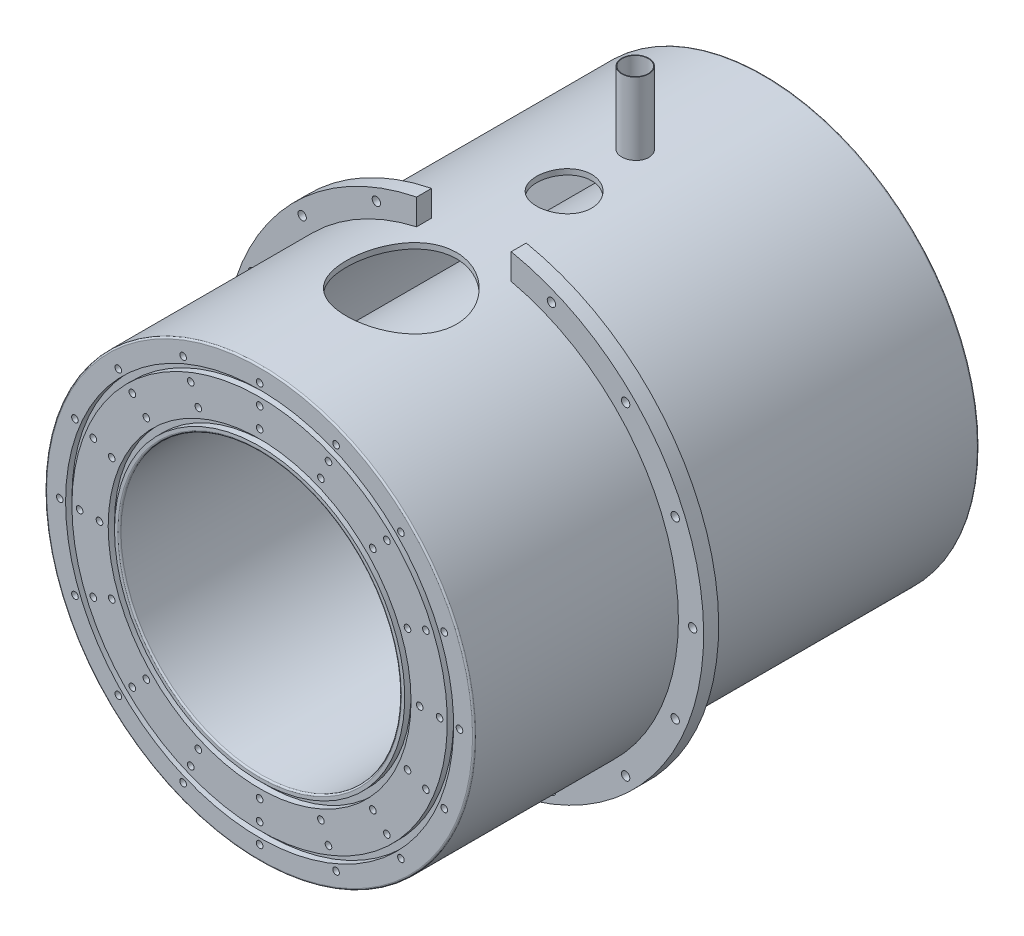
from build123d import *
from build123d.topology import SkipClean

# Parameters (mm, degrees)
SKETCH1_R                      = 92
SKETCH1_R_2                    = 88.9
BOSS_EXTRUDE1_DEPTH            = 140
SKETCH2_R                      = 136
SKETCH2_R_2                    = 132.5
BOSS_EXTRUDE2_DEPTH            = 140
BOSS_EXTRUDE3_START            = 20
SKETCH3_R                      = 136
SKETCH3_R_2                    = 88.9
BOSS_EXTRUDE3_DEPTH            = 20
SKETCH6_R                      = 17.4625
SKETCH6_R_2                    = 34.925
CUT_EXTRUDE5_DEPTH             = 25.4
SKETCH5_R                      = 8.6106
SKETCH5_R_2                    = 8.255
EXTRUDE_THIN1_DEPTH            = 50.8
SKETCH8_R                      = 152
SKETCH8_R_2                    = 136
BOSS_EXTRUDE5_DEPTH            = 9.525
SKETCH10_R                     = 123
SKETCH10_R_2                   = 119
CUT_EXTRUDE7_DEPTH             = 4
CUT_EXTRUDE8_START             = -4
SKETCH11_R                     = 96
SKETCH11_R_2                   = 92
CUT_EXTRUDE8_DEPTH             = 4
M5X0_8_TAPPED_HOLE1_AT_2_COUNT = 2
M5X0_8_TAPPED_HOLE1_AT_2_PITCH = 12.6
M5X0_8_TAPPED_HOLE1_AT_3_COUNT = 2
M5X0_8_TAPPED_HOLE1_AT_3_PITCH = 25.2
CIRPATTERN4_COUNT              = 16
CIRPATTERN5_COUNT              = 16
FILLET2_R                      = 1
CUT_EXTRUDE9_DEPTH             = 10
CUT_EXTRUDE9_DEPTH_BACK        = 15


with BuildPart() as part:
    # Sketch1 → Boss-Extrude1 (new, symmetric)
    with BuildSketch(Plane.XY):
        Circle(SKETCH1_R)
        Circle(SKETCH1_R_2, mode=Mode.SUBTRACT)
    extrude(amount=BOSS_EXTRUDE1_DEPTH, both=True)



with BuildPart() as body_2:
    # Sketch2 → Boss-Extrude2 (new, symmetric)
    with BuildSketch(Plane.XY):
        Circle(SKETCH2_R)
        Circle(SKETCH2_R_2, mode=Mode.SUBTRACT)
    extrude(amount=BOSS_EXTRUDE2_DEPTH, both=True)


with BuildPart() as part_1:
    with SkipClean():  # the faces are left unmerged after this step: merging them gives an invalid solid
        add(part.part)

        add(body_2.part)  # Boss-Extrude3 merges body 2
        # Sketch3 → Boss-Extrude3 (add)
        with BuildSketch(Plane(origin=(0, 0, -140), x_dir=(-1, 0, 0), z_dir=(0, 0, -1)).offset(BOSS_EXTRUDE3_START)):
            with Locations(Location((0, 0, 0), (0, 0, 180))):
                Circle(SKETCH3_R)
            Circle(SKETCH3_R_2, mode=Mode.SUBTRACT)
        boss_extrude3 = extrude(amount=-BOSS_EXTRUDE3_DEPTH)

    # Mirror1: Boss-Extrude3 across plane
    with SkipClean():  # the faces are left unmerged after this step: merging them gives an invalid solid
        add(boss_extrude3.mirror(Plane.XY))

    # Sketch6 → Cut-Extrude5 (cut)
    with SkipClean():  # the faces are left unmerged after this step: merging them gives an invalid solid
        with BuildSketch(Plane(origin=(0, 114.3, 0), x_dir=(-1, 0, 0), z_dir=(0, 1, 0))):
            with Locations(Location((0, -33, 0), (0, 0, 270))):
                Circle(SKETCH6_R)
            with Locations(Location((0, 70.13952, 0), (0, 0, 270))):
                Circle(SKETCH6_R_2)
        extrude(amount=CUT_EXTRUDE5_DEPTH, mode=Mode.SUBTRACT)

    # Sketch8 → Boss-Extrude5 (add)
    with SkipClean():  # the faces are left unmerged after this step: merging them gives an invalid solid
        with BuildSketch(Plane(origin=(0, 0, 30.5), x_dir=(-1, 0, 0), z_dir=(0, 0, -1))):
            with Locations(Location((0, 0, 0), (0, 0, 180))):
                Circle(SKETCH8_R)
            Circle(SKETCH8_R_2, mode=Mode.SUBTRACT)
        extrude(amount=BOSS_EXTRUDE5_DEPTH)

    # Sketch10 → Cut-Extrude7 (cut)
    with SkipClean():  # the faces are left unmerged after this step: merging them gives an invalid solid
        with BuildSketch(Plane(origin=(0, 0, -160), x_dir=(-1, 0, 0), z_dir=(0, 0, -1))):
            Circle(SKETCH10_R)
            Circle(SKETCH10_R_2, mode=Mode.SUBTRACT)
        cut_extrude7 = extrude(amount=-CUT_EXTRUDE7_DEPTH, mode=Mode.SUBTRACT)

    # Sketch11 → Cut-Extrude8 (cut)
    with SkipClean():  # the faces are left unmerged after this step: merging them gives an invalid solid
        with BuildSketch(Plane(origin=(0, 0, -160), x_dir=(-1, 0, 0), z_dir=(0, 0, -1)).offset(CUT_EXTRUDE8_START)):
            Circle(SKETCH11_R)
            Circle(SKETCH11_R_2, mode=Mode.SUBTRACT)
        cut_extrude8 = extrude(amount=CUT_EXTRUDE8_DEPTH, mode=Mode.SUBTRACT)

    # Mirror3: Cut-Extrude7, Cut-Extrude8 across plane
    with SkipClean():  # the faces are left unmerged after this step: merging them gives an invalid solid
        add(cut_extrude7.mirror(Plane.XY), mode=Mode.SUBTRACT)
        add(cut_extrude8.mirror(Plane.XY), mode=Mode.SUBTRACT)

    # Sketch12 → M5x0.8 Tapped Hole1 (revolve, cut)
    with SkipClean():  # the faces are left unmerged after this step: merging them gives an invalid solid
        with BuildSketch(Plane(origin=(-101.5, 0, -160), x_dir=(0, 1, 0), z_dir=(1, 0, 0))):
            Polygon((0, 0), (0, 13.6618073), (2.1, 12.4), (2.1, 0), align=None)
        m5x0_8_tapped_hole1 = revolve(axis=Axis((-101.5, 0, -166.35), (0, 0, 1)), mode=Mode.SUBTRACT)

    # M5x0.8 Tapped Hole1 at 2: M5x0.8 Tapped Hole1 ×2
    with SkipClean():  # the faces are left unmerged after this step: merging them gives an invalid solid
        with Locations(*[(-i * M5X0_8_TAPPED_HOLE1_AT_2_PITCH, 0, 0) for i in range(1, M5X0_8_TAPPED_HOLE1_AT_2_COUNT)]):
            add(m5x0_8_tapped_hole1, mode=Mode.SUBTRACT)

    # M5x0.8 Tapped Hole1 at 3: M5x0.8 Tapped Hole1 ×2
    with SkipClean():  # the faces are left unmerged after this step: merging them gives an invalid solid
        with Locations(*[(-i * M5X0_8_TAPPED_HOLE1_AT_3_PITCH, 0, 0) for i in range(1, M5X0_8_TAPPED_HOLE1_AT_3_COUNT)]):
            add(m5x0_8_tapped_hole1, mode=Mode.SUBTRACT)

    # Sketch13 → M5 Clearance Hole1 (revolve, cut)
    with SkipClean():  # the faces are left unmerged after this step: merging them gives an invalid solid
        with BuildSketch(Plane(origin=(0, 145, 20.975), x_dir=(0, 1, 0), z_dir=(1, 0, 0))):
            Polygon((0, 0), (0, 26.99228064), (2.65, 25.4), (2.65, 0), align=None)
        m5_clearance_hole1 = revolve(axis=Axis((0, 145, 14.625), (0, 0, 1)), mode=Mode.SUBTRACT)

    # CirPattern4: M5 Clearance Hole1 ×16 about axis
    with SkipClean():  # the faces are left unmerged after this step: merging them gives an invalid solid
        cirpattern4_axis = Axis((0, 0, 0), (0, 0, 1))
        for i in range(1, CIRPATTERN4_COUNT):
            add(m5_clearance_hole1.rotate(cirpattern4_axis, i * 360 / CIRPATTERN4_COUNT), mode=Mode.SUBTRACT)

    # Mirror4: M5x0.8 Tapped Hole1 across plane
    with SkipClean():  # the faces are left unmerged after this step: merging them gives an invalid solid
        add(m5x0_8_tapped_hole1.mirror(Plane.XY), mode=Mode.SUBTRACT)

    # Mirror4 copy 1 sketch → Mirror4 copy 1 (revolve, cut)
    with SkipClean():  # the faces are left unmerged after this step: merging them gives an invalid solid
        with BuildSketch(Plane(origin=(-114.1, 0, 160), x_dir=(0, 1, 0), z_dir=(1, 0, 0))):
            Polygon((0, 0), (0, -13.6618073), (2.1, -12.4), (2.1, 0), align=None)
        revolve(axis=Axis((-114.1, 0, 166.35), (0, 0, 1)), mode=Mode.SUBTRACT)

    # Mirror4 copy 2 sketch → Mirror4 copy 2 (revolve, cut)
    with SkipClean():  # the faces are left unmerged after this step: merging them gives an invalid solid
        with BuildSketch(Plane(origin=(-126.7, 0, 160), x_dir=(0, 1, 0), z_dir=(1, 0, 0))):
            Polygon((0, 0), (0, -13.6618073), (2.1, -12.4), (2.1, 0), align=None)
        revolve(axis=Axis((-126.7, 0, 166.35), (0, 0, 1)), mode=Mode.SUBTRACT)

    # CirPattern5: M5x0.8 Tapped Hole1 ×16 about axis
    with SkipClean():  # the faces are left unmerged after this step: merging them gives an invalid solid
        cirpattern5_axis = Axis((0, 0, 0), (0, 0, 1))
        for i in range(1, CIRPATTERN5_COUNT):
            add(m5x0_8_tapped_hole1.rotate(cirpattern5_axis, i * 360 / CIRPATTERN5_COUNT), mode=Mode.SUBTRACT)

    # CirPattern5 copy 1 sketch → CirPattern5 copy 1 (revolve, cut)
    with SkipClean():  # the faces are left unmerged after this step: merging them gives an invalid solid
        with BuildSketch(Plane(origin=(-105.41465466, -43.664179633, -160), x_dir=(-0.3826834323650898, 0.9238795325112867, 0), z_dir=(0.9238795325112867, 0.3826834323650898, 0))):
            Polygon((0, 0), (0, 13.6618073), (2.1, 12.4), (2.1, 0), align=None)
        revolve(axis=Axis((-105.41465466, -43.664179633, -166.35), (0, 0, 1)), mode=Mode.SUBTRACT)

    # CirPattern5 copy 2 sketch → CirPattern5 copy 2 (revolve, cut)
    with SkipClean():  # the faces are left unmerged after this step: merging them gives an invalid solid
        with BuildSketch(Plane(origin=(-80.680883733, -80.680883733, -160), x_dir=(-0.7071067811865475, 0.7071067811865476, 0), z_dir=(0.7071067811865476, 0.7071067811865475, 0))):
            Polygon((0, 0), (0, 13.6618073), (2.1, 12.4), (2.1, 0), align=None)
        revolve(axis=Axis((-80.680883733, -80.680883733, -166.35), (0, 0, 1)), mode=Mode.SUBTRACT)

    # CirPattern5 copy 3 sketch → CirPattern5 copy 3 (revolve, cut)
    with SkipClean():  # the faces are left unmerged after this step: merging them gives an invalid solid
        with BuildSketch(Plane(origin=(-43.664179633, -105.41465466, -160), x_dir=(-0.9238795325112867, 0.38268343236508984, 0), z_dir=(0.38268343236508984, 0.9238795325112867, 0))):
            Polygon((0, 0), (0, 13.6618073), (2.1, 12.4), (2.1, 0), align=None)
        revolve(axis=Axis((-43.664179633, -105.41465466, -166.35), (0, 0, 1)), mode=Mode.SUBTRACT)

    # CirPattern5 copy 4 sketch → CirPattern5 copy 4 (revolve, cut)
    with SkipClean():  # the faces are left unmerged after this step: merging them gives an invalid solid
        with BuildSketch(Plane(origin=(0, -114.1, -160), x_dir=(-1, 0, 0), z_dir=(0, 1, 0))):
            Polygon((0, 0), (0, 13.6618073), (2.1, 12.4), (2.1, 0), align=None)
        revolve(axis=Axis((0, -114.1, -166.35), (0, 0, 1)), mode=Mode.SUBTRACT)

    # CirPattern5 copy 5 sketch → CirPattern5 copy 5 (revolve, cut)
    with SkipClean():  # the faces are left unmerged after this step: merging them gives an invalid solid
        with BuildSketch(Plane(origin=(43.664179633, -105.41465466, -160), x_dir=(-0.9238795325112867, -0.3826834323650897, 0), z_dir=(-0.3826834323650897, 0.9238795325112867, 0))):
            Polygon((0, 0), (0, 13.6618073), (2.1, 12.4), (2.1, 0), align=None)
        revolve(axis=Axis((43.664179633, -105.41465466, -166.35), (0, 0, 1)), mode=Mode.SUBTRACT)

    # CirPattern5 copy 6 sketch → CirPattern5 copy 6 (revolve, cut)
    with SkipClean():  # the faces are left unmerged after this step: merging them gives an invalid solid
        with BuildSketch(Plane(origin=(80.680883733, -80.680883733, -160), x_dir=(-0.7071067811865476, -0.7071067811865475, 0), z_dir=(-0.7071067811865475, 0.7071067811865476, 0))):
            Polygon((0, 0), (0, 13.6618073), (2.1, 12.4), (2.1, 0), align=None)
        revolve(axis=Axis((80.680883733, -80.680883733, -166.35), (0, 0, 1)), mode=Mode.SUBTRACT)

    # CirPattern5 copy 7 sketch → CirPattern5 copy 7 (revolve, cut)
    with SkipClean():  # the faces are left unmerged after this step: merging them gives an invalid solid
        with BuildSketch(Plane(origin=(105.41465466, -43.664179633, -160), x_dir=(-0.3826834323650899, -0.9238795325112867, 0), z_dir=(-0.9238795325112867, 0.3826834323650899, 0))):
            Polygon((0, 0), (0, 13.6618073), (2.1, 12.4), (2.1, 0), align=None)
        revolve(axis=Axis((105.41465466, -43.664179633, -166.35), (0, 0, 1)), mode=Mode.SUBTRACT)

    # CirPattern5 copy 8 sketch → CirPattern5 copy 8 (revolve, cut)
    with SkipClean():  # the faces are left unmerged after this step: merging them gives an invalid solid
        with BuildSketch(Plane(origin=(114.1, 0, -160), x_dir=(0, -1, 0), z_dir=(-1, 0, 0))):
            Polygon((0, 0), (0, 13.6618073), (2.1, 12.4), (2.1, 0), align=None)
        revolve(axis=Axis((114.1, 0, -166.35), (0, 0, 1)), mode=Mode.SUBTRACT)

    # CirPattern5 copy 9 sketch → CirPattern5 copy 9 (revolve, cut)
    with SkipClean():  # the faces are left unmerged after this step: merging them gives an invalid solid
        with BuildSketch(Plane(origin=(105.41465466, 43.664179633, -160), x_dir=(0.38268343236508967, -0.9238795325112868, 0), z_dir=(-0.9238795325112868, -0.38268343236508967, 0))):
            Polygon((0, 0), (0, 13.6618073), (2.1, 12.4), (2.1, 0), align=None)
        revolve(axis=Axis((105.41465466, 43.664179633, -166.35), (0, 0, 1)), mode=Mode.SUBTRACT)

    # CirPattern5 copy 10 sketch → CirPattern5 copy 10 (revolve, cut)
    with SkipClean():  # the faces are left unmerged after this step: merging them gives an invalid solid
        with BuildSketch(Plane(origin=(80.680883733, 80.680883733, -160), x_dir=(0.7071067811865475, -0.7071067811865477, 0), z_dir=(-0.7071067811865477, -0.7071067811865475, 0))):
            Polygon((0, 0), (0, 13.6618073), (2.1, 12.4), (2.1, 0), align=None)
        revolve(axis=Axis((80.680883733, 80.680883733, -166.35), (0, 0, 1)), mode=Mode.SUBTRACT)

    # CirPattern5 copy 11 sketch → CirPattern5 copy 11 (revolve, cut)
    with SkipClean():  # the faces are left unmerged after this step: merging them gives an invalid solid
        with BuildSketch(Plane(origin=(43.664179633, 105.41465466, -160), x_dir=(0.9238795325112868, -0.3826834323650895, 0), z_dir=(-0.3826834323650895, -0.9238795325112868, 0))):
            Polygon((0, 0), (0, 13.6618073), (2.1, 12.4), (2.1, 0), align=None)
        revolve(axis=Axis((43.664179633, 105.41465466, -166.35), (0, 0, 1)), mode=Mode.SUBTRACT)

    # CirPattern5 copy 12 sketch → CirPattern5 copy 12 (revolve, cut)
    with SkipClean():  # the faces are left unmerged after this step: merging them gives an invalid solid
        with BuildSketch(Plane(origin=(0, 114.1, -160), x_dir=(1, 0, 0), z_dir=(0, -1, 0))):
            Polygon((0, 0), (0, 13.6618073), (2.1, 12.4), (2.1, 0), align=None)
        revolve(axis=Axis((0, 114.1, -166.35), (0, 0, 1)), mode=Mode.SUBTRACT)

    # CirPattern5 copy 13 sketch → CirPattern5 copy 13 (revolve, cut)
    with SkipClean():  # the faces are left unmerged after this step: merging them gives an invalid solid
        with BuildSketch(Plane(origin=(-43.664179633, 105.41465466, -160), x_dir=(0.9238795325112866, 0.38268343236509, 0), z_dir=(0.38268343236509, -0.9238795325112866, 0))):
            Polygon((0, 0), (0, 13.6618073), (2.1, 12.4), (2.1, 0), align=None)
        revolve(axis=Axis((-43.664179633, 105.41465466, -166.35), (0, 0, 1)), mode=Mode.SUBTRACT)

    # CirPattern5 copy 14 sketch → CirPattern5 copy 14 (revolve, cut)
    with SkipClean():  # the faces are left unmerged after this step: merging them gives an invalid solid
        with BuildSketch(Plane(origin=(-80.680883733, 80.680883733, -160), x_dir=(0.7071067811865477, 0.7071067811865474, 0), z_dir=(0.7071067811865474, -0.7071067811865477, 0))):
            Polygon((0, 0), (0, 13.6618073), (2.1, 12.4), (2.1, 0), align=None)
        revolve(axis=Axis((-80.680883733, 80.680883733, -166.35), (0, 0, 1)), mode=Mode.SUBTRACT)

    # CirPattern5 copy 15 sketch → CirPattern5 copy 15 (revolve, cut)
    with SkipClean():  # the faces are left unmerged after this step: merging them gives an invalid solid
        with BuildSketch(Plane(origin=(-105.41465466, 43.664179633, -160), x_dir=(0.38268343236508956, 0.9238795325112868, 0), z_dir=(0.9238795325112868, -0.38268343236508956, 0))):
            Polygon((0, 0), (0, 13.6618073), (2.1, 12.4), (2.1, 0), align=None)
        revolve(axis=Axis((-105.41465466, 43.664179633, -166.35), (0, 0, 1)), mode=Mode.SUBTRACT)

    # CirPattern5 copy 16 sketch → CirPattern5 copy 16 (revolve, cut)
    with SkipClean():  # the faces are left unmerged after this step: merging them gives an invalid solid
        with BuildSketch(Plane(origin=(-117.055536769, -48.485990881, -160), x_dir=(-0.3826834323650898, 0.9238795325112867, 0), z_dir=(0.9238795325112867, 0.3826834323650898, 0))):
            Polygon((0, 0), (0, 13.6618073), (2.1, 12.4), (2.1, 0), align=None)
        revolve(axis=Axis((-117.055536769, -48.485990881, -166.35), (0, 0, 1)), mode=Mode.SUBTRACT)

    # CirPattern5 copy 17 sketch → CirPattern5 copy 17 (revolve, cut)
    with SkipClean():  # the faces are left unmerged after this step: merging them gives an invalid solid
        with BuildSketch(Plane(origin=(-89.590429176, -89.590429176, -160), x_dir=(-0.7071067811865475, 0.7071067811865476, 0), z_dir=(0.7071067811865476, 0.7071067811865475, 0))):
            Polygon((0, 0), (0, 13.6618073), (2.1, 12.4), (2.1, 0), align=None)
        revolve(axis=Axis((-89.590429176, -89.590429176, -166.35), (0, 0, 1)), mode=Mode.SUBTRACT)

    # CirPattern5 copy 18 sketch → CirPattern5 copy 18 (revolve, cut)
    with SkipClean():  # the faces are left unmerged after this step: merging them gives an invalid solid
        with BuildSketch(Plane(origin=(-48.485990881, -117.055536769, -160), x_dir=(-0.9238795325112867, 0.38268343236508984, 0), z_dir=(0.38268343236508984, 0.9238795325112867, 0))):
            Polygon((0, 0), (0, 13.6618073), (2.1, 12.4), (2.1, 0), align=None)
        revolve(axis=Axis((-48.485990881, -117.055536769, -166.35), (0, 0, 1)), mode=Mode.SUBTRACT)

    # CirPattern5 copy 19 sketch → CirPattern5 copy 19 (revolve, cut)
    with SkipClean():  # the faces are left unmerged after this step: merging them gives an invalid solid
        with BuildSketch(Plane(origin=(0, -126.7, -160), x_dir=(-1, 0, 0), z_dir=(0, 1, 0))):
            Polygon((0, 0), (0, 13.6618073), (2.1, 12.4), (2.1, 0), align=None)
        revolve(axis=Axis((0, -126.7, -166.35), (0, 0, 1)), mode=Mode.SUBTRACT)

    # CirPattern5 copy 20 sketch → CirPattern5 copy 20 (revolve, cut)
    with SkipClean():  # the faces are left unmerged after this step: merging them gives an invalid solid
        with BuildSketch(Plane(origin=(48.485990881, -117.055536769, -160), x_dir=(-0.9238795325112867, -0.3826834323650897, 0), z_dir=(-0.3826834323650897, 0.9238795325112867, 0))):
            Polygon((0, 0), (0, 13.6618073), (2.1, 12.4), (2.1, 0), align=None)
        revolve(axis=Axis((48.485990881, -117.055536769, -166.35), (0, 0, 1)), mode=Mode.SUBTRACT)

    # CirPattern5 copy 21 sketch → CirPattern5 copy 21 (revolve, cut)
    with SkipClean():  # the faces are left unmerged after this step: merging them gives an invalid solid
        with BuildSketch(Plane(origin=(89.590429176, -89.590429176, -160), x_dir=(-0.7071067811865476, -0.7071067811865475, 0), z_dir=(-0.7071067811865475, 0.7071067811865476, 0))):
            Polygon((0, 0), (0, 13.6618073), (2.1, 12.4), (2.1, 0), align=None)
        revolve(axis=Axis((89.590429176, -89.590429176, -166.35), (0, 0, 1)), mode=Mode.SUBTRACT)

    # CirPattern5 copy 22 sketch → CirPattern5 copy 22 (revolve, cut)
    with SkipClean():  # the faces are left unmerged after this step: merging them gives an invalid solid
        with BuildSketch(Plane(origin=(117.055536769, -48.485990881, -160), x_dir=(-0.3826834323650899, -0.9238795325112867, 0), z_dir=(-0.9238795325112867, 0.3826834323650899, 0))):
            Polygon((0, 0), (0, 13.6618073), (2.1, 12.4), (2.1, 0), align=None)
        revolve(axis=Axis((117.055536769, -48.485990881, -166.35), (0, 0, 1)), mode=Mode.SUBTRACT)

    # CirPattern5 copy 23 sketch → CirPattern5 copy 23 (revolve, cut)
    with SkipClean():  # the faces are left unmerged after this step: merging them gives an invalid solid
        with BuildSketch(Plane(origin=(126.7, 0, -160), x_dir=(0, -1, 0), z_dir=(-1, 0, 0))):
            Polygon((0, 0), (0, 13.6618073), (2.1, 12.4), (2.1, 0), align=None)
        revolve(axis=Axis((126.7, 0, -166.35), (0, 0, 1)), mode=Mode.SUBTRACT)

    # CirPattern5 copy 24 sketch → CirPattern5 copy 24 (revolve, cut)
    with SkipClean():  # the faces are left unmerged after this step: merging them gives an invalid solid
        with BuildSketch(Plane(origin=(117.055536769, 48.485990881, -160), x_dir=(0.38268343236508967, -0.9238795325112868, 0), z_dir=(-0.9238795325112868, -0.38268343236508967, 0))):
            Polygon((0, 0), (0, 13.6618073), (2.1, 12.4), (2.1, 0), align=None)
        revolve(axis=Axis((117.055536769, 48.485990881, -166.35), (0, 0, 1)), mode=Mode.SUBTRACT)

    # CirPattern5 copy 25 sketch → CirPattern5 copy 25 (revolve, cut)
    with SkipClean():  # the faces are left unmerged after this step: merging them gives an invalid solid
        with BuildSketch(Plane(origin=(89.590429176, 89.590429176, -160), x_dir=(0.7071067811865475, -0.7071067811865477, 0), z_dir=(-0.7071067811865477, -0.7071067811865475, 0))):
            Polygon((0, 0), (0, 13.6618073), (2.1, 12.4), (2.1, 0), align=None)
        revolve(axis=Axis((89.590429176, 89.590429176, -166.35), (0, 0, 1)), mode=Mode.SUBTRACT)

    # CirPattern5 copy 26 sketch → CirPattern5 copy 26 (revolve, cut)
    with SkipClean():  # the faces are left unmerged after this step: merging them gives an invalid solid
        with BuildSketch(Plane(origin=(48.485990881, 117.055536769, -160), x_dir=(0.9238795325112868, -0.3826834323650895, 0), z_dir=(-0.3826834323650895, -0.9238795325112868, 0))):
            Polygon((0, 0), (0, 13.6618073), (2.1, 12.4), (2.1, 0), align=None)
        revolve(axis=Axis((48.485990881, 117.055536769, -166.35), (0, 0, 1)), mode=Mode.SUBTRACT)

    # CirPattern5 copy 27 sketch → CirPattern5 copy 27 (revolve, cut)
    with SkipClean():  # the faces are left unmerged after this step: merging them gives an invalid solid
        with BuildSketch(Plane(origin=(0, 126.7, -160), x_dir=(1, 0, 0), z_dir=(0, -1, 0))):
            Polygon((0, 0), (0, 13.6618073), (2.1, 12.4), (2.1, 0), align=None)
        revolve(axis=Axis((0, 126.7, -166.35), (0, 0, 1)), mode=Mode.SUBTRACT)

    # CirPattern5 copy 28 sketch → CirPattern5 copy 28 (revolve, cut)
    with SkipClean():  # the faces are left unmerged after this step: merging them gives an invalid solid
        with BuildSketch(Plane(origin=(-48.485990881, 117.055536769, -160), x_dir=(0.9238795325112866, 0.38268343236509, 0), z_dir=(0.38268343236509, -0.9238795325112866, 0))):
            Polygon((0, 0), (0, 13.6618073), (2.1, 12.4), (2.1, 0), align=None)
        revolve(axis=Axis((-48.485990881, 117.055536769, -166.35), (0, 0, 1)), mode=Mode.SUBTRACT)

    # CirPattern5 copy 29 sketch → CirPattern5 copy 29 (revolve, cut)
    with SkipClean():  # the faces are left unmerged after this step: merging them gives an invalid solid
        with BuildSketch(Plane(origin=(-89.590429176, 89.590429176, -160), x_dir=(0.7071067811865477, 0.7071067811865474, 0), z_dir=(0.7071067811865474, -0.7071067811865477, 0))):
            Polygon((0, 0), (0, 13.6618073), (2.1, 12.4), (2.1, 0), align=None)
        revolve(axis=Axis((-89.590429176, 89.590429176, -166.35), (0, 0, 1)), mode=Mode.SUBTRACT)

    # CirPattern5 copy 30 sketch → CirPattern5 copy 30 (revolve, cut)
    with SkipClean():  # the faces are left unmerged after this step: merging them gives an invalid solid
        with BuildSketch(Plane(origin=(-117.055536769, 48.485990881, -160), x_dir=(0.38268343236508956, 0.9238795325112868, 0), z_dir=(0.9238795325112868, -0.38268343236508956, 0))):
            Polygon((0, 0), (0, 13.6618073), (2.1, 12.4), (2.1, 0), align=None)
        revolve(axis=Axis((-117.055536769, 48.485990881, -166.35), (0, 0, 1)), mode=Mode.SUBTRACT)

    # CirPattern5 copy 31 sketch → CirPattern5 copy 31 (revolve, cut)
    with SkipClean():  # the faces are left unmerged after this step: merging them gives an invalid solid
        with BuildSketch(Plane(origin=(-93.77377255, -38.842368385, 160), x_dir=(-0.3826834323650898, 0.9238795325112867, 0), z_dir=(0.9238795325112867, 0.3826834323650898, 0))):
            Polygon((0, 0), (0, -13.6618073), (2.1, -12.4), (2.1, 0), align=None)
        revolve(axis=Axis((-93.77377255, -38.842368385, 166.35), (0, 0, 1)), mode=Mode.SUBTRACT)

    # CirPattern5 copy 32 sketch → CirPattern5 copy 32 (revolve, cut)
    with SkipClean():  # the faces are left unmerged after this step: merging them gives an invalid solid
        with BuildSketch(Plane(origin=(-71.77133829, -71.77133829, 160), x_dir=(-0.7071067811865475, 0.7071067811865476, 0), z_dir=(0.7071067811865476, 0.7071067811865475, 0))):
            Polygon((0, 0), (0, -13.6618073), (2.1, -12.4), (2.1, 0), align=None)
        revolve(axis=Axis((-71.77133829, -71.77133829, 166.35), (0, 0, 1)), mode=Mode.SUBTRACT)

    # CirPattern5 copy 33 sketch → CirPattern5 copy 33 (revolve, cut)
    with SkipClean():  # the faces are left unmerged after this step: merging them gives an invalid solid
        with BuildSketch(Plane(origin=(-38.842368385, -93.77377255, 160), x_dir=(-0.9238795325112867, 0.38268343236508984, 0), z_dir=(0.38268343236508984, 0.9238795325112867, 0))):
            Polygon((0, 0), (0, -13.6618073), (2.1, -12.4), (2.1, 0), align=None)
        revolve(axis=Axis((-38.842368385, -93.77377255, 166.35), (0, 0, 1)), mode=Mode.SUBTRACT)

    # CirPattern5 copy 34 sketch → CirPattern5 copy 34 (revolve, cut)
    with SkipClean():  # the faces are left unmerged after this step: merging them gives an invalid solid
        with BuildSketch(Plane(origin=(0, -101.5, 160), x_dir=(-1, 0, 0), z_dir=(0, 1, 0))):
            Polygon((0, 0), (0, -13.6618073), (2.1, -12.4), (2.1, 0), align=None)
        revolve(axis=Axis((0, -101.5, 166.35), (0, 0, 1)), mode=Mode.SUBTRACT)

    # CirPattern5 copy 35 sketch → CirPattern5 copy 35 (revolve, cut)
    with SkipClean():  # the faces are left unmerged after this step: merging them gives an invalid solid
        with BuildSketch(Plane(origin=(38.842368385, -93.77377255, 160), x_dir=(-0.9238795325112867, -0.3826834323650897, 0), z_dir=(-0.3826834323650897, 0.9238795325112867, 0))):
            Polygon((0, 0), (0, -13.6618073), (2.1, -12.4), (2.1, 0), align=None)
        revolve(axis=Axis((38.842368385, -93.77377255, 166.35), (0, 0, 1)), mode=Mode.SUBTRACT)

    # CirPattern5 copy 36 sketch → CirPattern5 copy 36 (revolve, cut)
    with SkipClean():  # the faces are left unmerged after this step: merging them gives an invalid solid
        with BuildSketch(Plane(origin=(71.77133829, -71.77133829, 160), x_dir=(-0.7071067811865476, -0.7071067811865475, 0), z_dir=(-0.7071067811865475, 0.7071067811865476, 0))):
            Polygon((0, 0), (0, -13.6618073), (2.1, -12.4), (2.1, 0), align=None)
        revolve(axis=Axis((71.77133829, -71.77133829, 166.35), (0, 0, 1)), mode=Mode.SUBTRACT)

    # CirPattern5 copy 37 sketch → CirPattern5 copy 37 (revolve, cut)
    with SkipClean():  # the faces are left unmerged after this step: merging them gives an invalid solid
        with BuildSketch(Plane(origin=(93.77377255, -38.842368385, 160), x_dir=(-0.3826834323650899, -0.9238795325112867, 0), z_dir=(-0.9238795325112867, 0.3826834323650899, 0))):
            Polygon((0, 0), (0, -13.6618073), (2.1, -12.4), (2.1, 0), align=None)
        revolve(axis=Axis((93.77377255, -38.842368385, 166.35), (0, 0, 1)), mode=Mode.SUBTRACT)

    # CirPattern5 copy 38 sketch → CirPattern5 copy 38 (revolve, cut)
    with SkipClean():  # the faces are left unmerged after this step: merging them gives an invalid solid
        with BuildSketch(Plane(origin=(101.5, 0, 160), x_dir=(0, -1, 0), z_dir=(-1, 0, 0))):
            Polygon((0, 0), (0, -13.6618073), (2.1, -12.4), (2.1, 0), align=None)
        revolve(axis=Axis((101.5, 0, 166.35), (0, 0, 1)), mode=Mode.SUBTRACT)

    # CirPattern5 copy 39 sketch → CirPattern5 copy 39 (revolve, cut)
    with SkipClean():  # the faces are left unmerged after this step: merging them gives an invalid solid
        with BuildSketch(Plane(origin=(93.77377255, 38.842368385, 160), x_dir=(0.38268343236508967, -0.9238795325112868, 0), z_dir=(-0.9238795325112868, -0.38268343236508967, 0))):
            Polygon((0, 0), (0, -13.6618073), (2.1, -12.4), (2.1, 0), align=None)
        revolve(axis=Axis((93.77377255, 38.842368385, 166.35), (0, 0, 1)), mode=Mode.SUBTRACT)

    # CirPattern5 copy 40 sketch → CirPattern5 copy 40 (revolve, cut)
    with SkipClean():  # the faces are left unmerged after this step: merging them gives an invalid solid
        with BuildSketch(Plane(origin=(71.77133829, 71.77133829, 160), x_dir=(0.7071067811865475, -0.7071067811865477, 0), z_dir=(-0.7071067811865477, -0.7071067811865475, 0))):
            Polygon((0, 0), (0, -13.6618073), (2.1, -12.4), (2.1, 0), align=None)
        revolve(axis=Axis((71.77133829, 71.77133829, 166.35), (0, 0, 1)), mode=Mode.SUBTRACT)

    # CirPattern5 copy 41 sketch → CirPattern5 copy 41 (revolve, cut)
    with SkipClean():  # the faces are left unmerged after this step: merging them gives an invalid solid
        with BuildSketch(Plane(origin=(38.842368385, 93.77377255, 160), x_dir=(0.9238795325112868, -0.3826834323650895, 0), z_dir=(-0.3826834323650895, -0.9238795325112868, 0))):
            Polygon((0, 0), (0, -13.6618073), (2.1, -12.4), (2.1, 0), align=None)
        revolve(axis=Axis((38.842368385, 93.77377255, 166.35), (0, 0, 1)), mode=Mode.SUBTRACT)

    # CirPattern5 copy 42 sketch → CirPattern5 copy 42 (revolve, cut)
    with SkipClean():  # the faces are left unmerged after this step: merging them gives an invalid solid
        with BuildSketch(Plane(origin=(0, 101.5, 160), x_dir=(1, 0, 0), z_dir=(0, -1, 0))):
            Polygon((0, 0), (0, -13.6618073), (2.1, -12.4), (2.1, 0), align=None)
        revolve(axis=Axis((0, 101.5, 166.35), (0, 0, 1)), mode=Mode.SUBTRACT)

    # CirPattern5 copy 43 sketch → CirPattern5 copy 43 (revolve, cut)
    with SkipClean():  # the faces are left unmerged after this step: merging them gives an invalid solid
        with BuildSketch(Plane(origin=(-38.842368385, 93.77377255, 160), x_dir=(0.9238795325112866, 0.38268343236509, 0), z_dir=(0.38268343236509, -0.9238795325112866, 0))):
            Polygon((0, 0), (0, -13.6618073), (2.1, -12.4), (2.1, 0), align=None)
        revolve(axis=Axis((-38.842368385, 93.77377255, 166.35), (0, 0, 1)), mode=Mode.SUBTRACT)

    # CirPattern5 copy 44 sketch → CirPattern5 copy 44 (revolve, cut)
    with SkipClean():  # the faces are left unmerged after this step: merging them gives an invalid solid
        with BuildSketch(Plane(origin=(-71.77133829, 71.77133829, 160), x_dir=(0.7071067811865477, 0.7071067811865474, 0), z_dir=(0.7071067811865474, -0.7071067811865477, 0))):
            Polygon((0, 0), (0, -13.6618073), (2.1, -12.4), (2.1, 0), align=None)
        revolve(axis=Axis((-71.77133829, 71.77133829, 166.35), (0, 0, 1)), mode=Mode.SUBTRACT)

    # CirPattern5 copy 45 sketch → CirPattern5 copy 45 (revolve, cut)
    with SkipClean():  # the faces are left unmerged after this step: merging them gives an invalid solid
        with BuildSketch(Plane(origin=(-93.77377255, 38.842368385, 160), x_dir=(0.38268343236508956, 0.9238795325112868, 0), z_dir=(0.9238795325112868, -0.38268343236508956, 0))):
            Polygon((0, 0), (0, -13.6618073), (2.1, -12.4), (2.1, 0), align=None)
        revolve(axis=Axis((-93.77377255, 38.842368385, 166.35), (0, 0, 1)), mode=Mode.SUBTRACT)

    # CirPattern5 copy 46 sketch → CirPattern5 copy 46 (revolve, cut)
    with SkipClean():  # the faces are left unmerged after this step: merging them gives an invalid solid
        with BuildSketch(Plane(origin=(-105.41465466, -43.664179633, 160), x_dir=(-0.3826834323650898, 0.9238795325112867, 0), z_dir=(0.9238795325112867, 0.3826834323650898, 0))):
            Polygon((0, 0), (0, -13.6618073), (2.1, -12.4), (2.1, 0), align=None)
        revolve(axis=Axis((-105.41465466, -43.664179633, 166.35), (0, 0, 1)), mode=Mode.SUBTRACT)

    # CirPattern5 copy 47 sketch → CirPattern5 copy 47 (revolve, cut)
    with SkipClean():  # the faces are left unmerged after this step: merging them gives an invalid solid
        with BuildSketch(Plane(origin=(-80.680883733, -80.680883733, 160), x_dir=(-0.7071067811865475, 0.7071067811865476, 0), z_dir=(0.7071067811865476, 0.7071067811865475, 0))):
            Polygon((0, 0), (0, -13.6618073), (2.1, -12.4), (2.1, 0), align=None)
        revolve(axis=Axis((-80.680883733, -80.680883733, 166.35), (0, 0, 1)), mode=Mode.SUBTRACT)

    # CirPattern5 copy 48 sketch → CirPattern5 copy 48 (revolve, cut)
    with SkipClean():  # the faces are left unmerged after this step: merging them gives an invalid solid
        with BuildSketch(Plane(origin=(-43.664179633, -105.41465466, 160), x_dir=(-0.9238795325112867, 0.38268343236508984, 0), z_dir=(0.38268343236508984, 0.9238795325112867, 0))):
            Polygon((0, 0), (0, -13.6618073), (2.1, -12.4), (2.1, 0), align=None)
        revolve(axis=Axis((-43.664179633, -105.41465466, 166.35), (0, 0, 1)), mode=Mode.SUBTRACT)

    # CirPattern5 copy 49 sketch → CirPattern5 copy 49 (revolve, cut)
    with SkipClean():  # the faces are left unmerged after this step: merging them gives an invalid solid
        with BuildSketch(Plane(origin=(0, -114.1, 160), x_dir=(-1, 0, 0), z_dir=(0, 1, 0))):
            Polygon((0, 0), (0, -13.6618073), (2.1, -12.4), (2.1, 0), align=None)
        revolve(axis=Axis((0, -114.1, 166.35), (0, 0, 1)), mode=Mode.SUBTRACT)

    # CirPattern5 copy 50 sketch → CirPattern5 copy 50 (revolve, cut)
    with SkipClean():  # the faces are left unmerged after this step: merging them gives an invalid solid
        with BuildSketch(Plane(origin=(43.664179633, -105.41465466, 160), x_dir=(-0.9238795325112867, -0.3826834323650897, 0), z_dir=(-0.3826834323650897, 0.9238795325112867, 0))):
            Polygon((0, 0), (0, -13.6618073), (2.1, -12.4), (2.1, 0), align=None)
        revolve(axis=Axis((43.664179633, -105.41465466, 166.35), (0, 0, 1)), mode=Mode.SUBTRACT)

    # CirPattern5 copy 51 sketch → CirPattern5 copy 51 (revolve, cut)
    with SkipClean():  # the faces are left unmerged after this step: merging them gives an invalid solid
        with BuildSketch(Plane(origin=(80.680883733, -80.680883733, 160), x_dir=(-0.7071067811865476, -0.7071067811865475, 0), z_dir=(-0.7071067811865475, 0.7071067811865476, 0))):
            Polygon((0, 0), (0, -13.6618073), (2.1, -12.4), (2.1, 0), align=None)
        revolve(axis=Axis((80.680883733, -80.680883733, 166.35), (0, 0, 1)), mode=Mode.SUBTRACT)

    # CirPattern5 copy 52 sketch → CirPattern5 copy 52 (revolve, cut)
    with SkipClean():  # the faces are left unmerged after this step: merging them gives an invalid solid
        with BuildSketch(Plane(origin=(105.41465466, -43.664179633, 160), x_dir=(-0.3826834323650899, -0.9238795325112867, 0), z_dir=(-0.9238795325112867, 0.3826834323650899, 0))):
            Polygon((0, 0), (0, -13.6618073), (2.1, -12.4), (2.1, 0), align=None)
        revolve(axis=Axis((105.41465466, -43.664179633, 166.35), (0, 0, 1)), mode=Mode.SUBTRACT)

    # CirPattern5 copy 53 sketch → CirPattern5 copy 53 (revolve, cut)
    with SkipClean():  # the faces are left unmerged after this step: merging them gives an invalid solid
        with BuildSketch(Plane(origin=(114.1, 0, 160), x_dir=(0, -1, 0), z_dir=(-1, 0, 0))):
            Polygon((0, 0), (0, -13.6618073), (2.1, -12.4), (2.1, 0), align=None)
        revolve(axis=Axis((114.1, 0, 166.35), (0, 0, 1)), mode=Mode.SUBTRACT)

    # CirPattern5 copy 54 sketch → CirPattern5 copy 54 (revolve, cut)
    with SkipClean():  # the faces are left unmerged after this step: merging them gives an invalid solid
        with BuildSketch(Plane(origin=(105.41465466, 43.664179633, 160), x_dir=(0.38268343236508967, -0.9238795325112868, 0), z_dir=(-0.9238795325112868, -0.38268343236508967, 0))):
            Polygon((0, 0), (0, -13.6618073), (2.1, -12.4), (2.1, 0), align=None)
        revolve(axis=Axis((105.41465466, 43.664179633, 166.35), (0, 0, 1)), mode=Mode.SUBTRACT)

    # CirPattern5 copy 55 sketch → CirPattern5 copy 55 (revolve, cut)
    with SkipClean():  # the faces are left unmerged after this step: merging them gives an invalid solid
        with BuildSketch(Plane(origin=(80.680883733, 80.680883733, 160), x_dir=(0.7071067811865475, -0.7071067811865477, 0), z_dir=(-0.7071067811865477, -0.7071067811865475, 0))):
            Polygon((0, 0), (0, -13.6618073), (2.1, -12.4), (2.1, 0), align=None)
        revolve(axis=Axis((80.680883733, 80.680883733, 166.35), (0, 0, 1)), mode=Mode.SUBTRACT)

    # CirPattern5 copy 56 sketch → CirPattern5 copy 56 (revolve, cut)
    with SkipClean():  # the faces are left unmerged after this step: merging them gives an invalid solid
        with BuildSketch(Plane(origin=(43.664179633, 105.41465466, 160), x_dir=(0.9238795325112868, -0.3826834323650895, 0), z_dir=(-0.3826834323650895, -0.9238795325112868, 0))):
            Polygon((0, 0), (0, -13.6618073), (2.1, -12.4), (2.1, 0), align=None)
        revolve(axis=Axis((43.664179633, 105.41465466, 166.35), (0, 0, 1)), mode=Mode.SUBTRACT)

    # CirPattern5 copy 57 sketch → CirPattern5 copy 57 (revolve, cut)
    with SkipClean():  # the faces are left unmerged after this step: merging them gives an invalid solid
        with BuildSketch(Plane(origin=(0, 114.1, 160), x_dir=(1, 0, 0), z_dir=(0, -1, 0))):
            Polygon((0, 0), (0, -13.6618073), (2.1, -12.4), (2.1, 0), align=None)
        revolve(axis=Axis((0, 114.1, 166.35), (0, 0, 1)), mode=Mode.SUBTRACT)

    # CirPattern5 copy 58 sketch → CirPattern5 copy 58 (revolve, cut)
    with SkipClean():  # the faces are left unmerged after this step: merging them gives an invalid solid
        with BuildSketch(Plane(origin=(-43.664179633, 105.41465466, 160), x_dir=(0.9238795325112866, 0.38268343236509, 0), z_dir=(0.38268343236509, -0.9238795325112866, 0))):
            Polygon((0, 0), (0, -13.6618073), (2.1, -12.4), (2.1, 0), align=None)
        revolve(axis=Axis((-43.664179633, 105.41465466, 166.35), (0, 0, 1)), mode=Mode.SUBTRACT)

    # CirPattern5 copy 59 sketch → CirPattern5 copy 59 (revolve, cut)
    with SkipClean():  # the faces are left unmerged after this step: merging them gives an invalid solid
        with BuildSketch(Plane(origin=(-80.680883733, 80.680883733, 160), x_dir=(0.7071067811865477, 0.7071067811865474, 0), z_dir=(0.7071067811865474, -0.7071067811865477, 0))):
            Polygon((0, 0), (0, -13.6618073), (2.1, -12.4), (2.1, 0), align=None)
        revolve(axis=Axis((-80.680883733, 80.680883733, 166.35), (0, 0, 1)), mode=Mode.SUBTRACT)

    # CirPattern5 copy 60 sketch → CirPattern5 copy 60 (revolve, cut)
    with SkipClean():  # the faces are left unmerged after this step: merging them gives an invalid solid
        with BuildSketch(Plane(origin=(-105.41465466, 43.664179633, 160), x_dir=(0.38268343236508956, 0.9238795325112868, 0), z_dir=(0.9238795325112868, -0.38268343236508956, 0))):
            Polygon((0, 0), (0, -13.6618073), (2.1, -12.4), (2.1, 0), align=None)
        revolve(axis=Axis((-105.41465466, 43.664179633, 166.35), (0, 0, 1)), mode=Mode.SUBTRACT)

    # CirPattern5 copy 61 sketch → CirPattern5 copy 61 (revolve, cut)
    with SkipClean():  # the faces are left unmerged after this step: merging them gives an invalid solid
        with BuildSketch(Plane(origin=(-117.055536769, -48.485990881, 160), x_dir=(-0.3826834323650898, 0.9238795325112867, 0), z_dir=(0.9238795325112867, 0.3826834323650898, 0))):
            Polygon((0, 0), (0, -13.6618073), (2.1, -12.4), (2.1, 0), align=None)
        revolve(axis=Axis((-117.055536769, -48.485990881, 166.35), (0, 0, 1)), mode=Mode.SUBTRACT)

    # CirPattern5 copy 62 sketch → CirPattern5 copy 62 (revolve, cut)
    with SkipClean():  # the faces are left unmerged after this step: merging them gives an invalid solid
        with BuildSketch(Plane(origin=(-89.590429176, -89.590429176, 160), x_dir=(-0.7071067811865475, 0.7071067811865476, 0), z_dir=(0.7071067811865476, 0.7071067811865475, 0))):
            Polygon((0, 0), (0, -13.6618073), (2.1, -12.4), (2.1, 0), align=None)
        revolve(axis=Axis((-89.590429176, -89.590429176, 166.35), (0, 0, 1)), mode=Mode.SUBTRACT)

    # CirPattern5 copy 63 sketch → CirPattern5 copy 63 (revolve, cut)
    with SkipClean():  # the faces are left unmerged after this step: merging them gives an invalid solid
        with BuildSketch(Plane(origin=(-48.485990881, -117.055536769, 160), x_dir=(-0.9238795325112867, 0.38268343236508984, 0), z_dir=(0.38268343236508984, 0.9238795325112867, 0))):
            Polygon((0, 0), (0, -13.6618073), (2.1, -12.4), (2.1, 0), align=None)
        revolve(axis=Axis((-48.485990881, -117.055536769, 166.35), (0, 0, 1)), mode=Mode.SUBTRACT)

    # CirPattern5 copy 64 sketch → CirPattern5 copy 64 (revolve, cut)
    with SkipClean():  # the faces are left unmerged after this step: merging them gives an invalid solid
        with BuildSketch(Plane(origin=(0, -126.7, 160), x_dir=(-1, 0, 0), z_dir=(0, 1, 0))):
            Polygon((0, 0), (0, -13.6618073), (2.1, -12.4), (2.1, 0), align=None)
        revolve(axis=Axis((0, -126.7, 166.35), (0, 0, 1)), mode=Mode.SUBTRACT)

    # CirPattern5 copy 65 sketch → CirPattern5 copy 65 (revolve, cut)
    with SkipClean():  # the faces are left unmerged after this step: merging them gives an invalid solid
        with BuildSketch(Plane(origin=(48.485990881, -117.055536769, 160), x_dir=(-0.9238795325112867, -0.3826834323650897, 0), z_dir=(-0.3826834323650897, 0.9238795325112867, 0))):
            Polygon((0, 0), (0, -13.6618073), (2.1, -12.4), (2.1, 0), align=None)
        revolve(axis=Axis((48.485990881, -117.055536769, 166.35), (0, 0, 1)), mode=Mode.SUBTRACT)

    # CirPattern5 copy 66 sketch → CirPattern5 copy 66 (revolve, cut)
    with SkipClean():  # the faces are left unmerged after this step: merging them gives an invalid solid
        with BuildSketch(Plane(origin=(89.590429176, -89.590429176, 160), x_dir=(-0.7071067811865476, -0.7071067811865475, 0), z_dir=(-0.7071067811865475, 0.7071067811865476, 0))):
            Polygon((0, 0), (0, -13.6618073), (2.1, -12.4), (2.1, 0), align=None)
        revolve(axis=Axis((89.590429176, -89.590429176, 166.35), (0, 0, 1)), mode=Mode.SUBTRACT)

    # CirPattern5 copy 67 sketch → CirPattern5 copy 67 (revolve, cut)
    with SkipClean():  # the faces are left unmerged after this step: merging them gives an invalid solid
        with BuildSketch(Plane(origin=(117.055536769, -48.485990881, 160), x_dir=(-0.3826834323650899, -0.9238795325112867, 0), z_dir=(-0.9238795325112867, 0.3826834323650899, 0))):
            Polygon((0, 0), (0, -13.6618073), (2.1, -12.4), (2.1, 0), align=None)
        revolve(axis=Axis((117.055536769, -48.485990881, 166.35), (0, 0, 1)), mode=Mode.SUBTRACT)

    # CirPattern5 copy 68 sketch → CirPattern5 copy 68 (revolve, cut)
    with SkipClean():  # the faces are left unmerged after this step: merging them gives an invalid solid
        with BuildSketch(Plane(origin=(126.7, 0, 160), x_dir=(0, -1, 0), z_dir=(-1, 0, 0))):
            Polygon((0, 0), (0, -13.6618073), (2.1, -12.4), (2.1, 0), align=None)
        revolve(axis=Axis((126.7, 0, 166.35), (0, 0, 1)), mode=Mode.SUBTRACT)

    # CirPattern5 copy 69 sketch → CirPattern5 copy 69 (revolve, cut)
    with SkipClean():  # the faces are left unmerged after this step: merging them gives an invalid solid
        with BuildSketch(Plane(origin=(117.055536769, 48.485990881, 160), x_dir=(0.38268343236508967, -0.9238795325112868, 0), z_dir=(-0.9238795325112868, -0.38268343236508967, 0))):
            Polygon((0, 0), (0, -13.6618073), (2.1, -12.4), (2.1, 0), align=None)
        revolve(axis=Axis((117.055536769, 48.485990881, 166.35), (0, 0, 1)), mode=Mode.SUBTRACT)

    # CirPattern5 copy 70 sketch → CirPattern5 copy 70 (revolve, cut)
    with SkipClean():  # the faces are left unmerged after this step: merging them gives an invalid solid
        with BuildSketch(Plane(origin=(89.590429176, 89.590429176, 160), x_dir=(0.7071067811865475, -0.7071067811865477, 0), z_dir=(-0.7071067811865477, -0.7071067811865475, 0))):
            Polygon((0, 0), (0, -13.6618073), (2.1, -12.4), (2.1, 0), align=None)
        revolve(axis=Axis((89.590429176, 89.590429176, 166.35), (0, 0, 1)), mode=Mode.SUBTRACT)

    # CirPattern5 copy 71 sketch → CirPattern5 copy 71 (revolve, cut)
    with SkipClean():  # the faces are left unmerged after this step: merging them gives an invalid solid
        with BuildSketch(Plane(origin=(48.485990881, 117.055536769, 160), x_dir=(0.9238795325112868, -0.3826834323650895, 0), z_dir=(-0.3826834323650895, -0.9238795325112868, 0))):
            Polygon((0, 0), (0, -13.6618073), (2.1, -12.4), (2.1, 0), align=None)
        revolve(axis=Axis((48.485990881, 117.055536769, 166.35), (0, 0, 1)), mode=Mode.SUBTRACT)

    # CirPattern5 copy 72 sketch → CirPattern5 copy 72 (revolve, cut)
    with SkipClean():  # the faces are left unmerged after this step: merging them gives an invalid solid
        with BuildSketch(Plane(origin=(0, 126.7, 160), x_dir=(1, 0, 0), z_dir=(0, -1, 0))):
            Polygon((0, 0), (0, -13.6618073), (2.1, -12.4), (2.1, 0), align=None)
        revolve(axis=Axis((0, 126.7, 166.35), (0, 0, 1)), mode=Mode.SUBTRACT)

    # CirPattern5 copy 73 sketch → CirPattern5 copy 73 (revolve, cut)
    with SkipClean():  # the faces are left unmerged after this step: merging them gives an invalid solid
        with BuildSketch(Plane(origin=(-48.485990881, 117.055536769, 160), x_dir=(0.9238795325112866, 0.38268343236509, 0), z_dir=(0.38268343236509, -0.9238795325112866, 0))):
            Polygon((0, 0), (0, -13.6618073), (2.1, -12.4), (2.1, 0), align=None)
        revolve(axis=Axis((-48.485990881, 117.055536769, 166.35), (0, 0, 1)), mode=Mode.SUBTRACT)

    # CirPattern5 copy 74 sketch → CirPattern5 copy 74 (revolve, cut)
    with SkipClean():  # the faces are left unmerged after this step: merging them gives an invalid solid
        with BuildSketch(Plane(origin=(-89.590429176, 89.590429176, 160), x_dir=(0.7071067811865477, 0.7071067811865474, 0), z_dir=(0.7071067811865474, -0.7071067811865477, 0))):
            Polygon((0, 0), (0, -13.6618073), (2.1, -12.4), (2.1, 0), align=None)
        revolve(axis=Axis((-89.590429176, 89.590429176, 166.35), (0, 0, 1)), mode=Mode.SUBTRACT)

    # CirPattern5 copy 75 sketch → CirPattern5 copy 75 (revolve, cut)
    with SkipClean():  # the faces are left unmerged after this step: merging them gives an invalid solid
        with BuildSketch(Plane(origin=(-117.055536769, 48.485990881, 160), x_dir=(0.38268343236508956, 0.9238795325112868, 0), z_dir=(0.9238795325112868, -0.38268343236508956, 0))):
            Polygon((0, 0), (0, -13.6618073), (2.1, -12.4), (2.1, 0), align=None)
        revolve(axis=Axis((-117.055536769, 48.485990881, 166.35), (0, 0, 1)), mode=Mode.SUBTRACT)

    # Fillet2
    fillet2_edges = [part_1.edges().sort_by_distance(p)[0] for p in [
        (88.9, 0, -160),
        (-136, 0, 160),
        (88.9, 0, 160),
        (-136, 0, -160),
    ]]
    fillet(fillet2_edges, radius=FILLET2_R)

    # Sketch14 → Cut-Extrude9 (cut, two sides: drawn at the far end of the back side and taken through both)
    with BuildSketch(Plane.XY.offset(30.5).offset(-CUT_EXTRUDE9_DEPTH_BACK)):
        with BuildLine():
            Line((30, 132.64991519), (30, 155))
            Line((30, 155), (-30, 155))
            Line((-30, 155), (-30, 132.64991519))
            ThreePointArc((-30, 132.64991519), (0, 136), (30, 132.64991519))
        make_face()
    extrude(amount=CUT_EXTRUDE9_DEPTH + CUT_EXTRUDE9_DEPTH_BACK, mode=Mode.SUBTRACT)


with BuildPart() as body_2_2:
    # Sketch5 → Extrude-Thin1 (new body)
    with BuildSketch(Plane(origin=(0, 130.81, 0), x_dir=(-1, 0, 0), z_dir=(0, 1, 0))):
        with Locations((0, -78.125)):
            Circle(SKETCH5_R)
        with Locations((0, -78.125)):
            Circle(SKETCH5_R_2, mode=Mode.SUBTRACT)
    extrude(amount=EXTRUDE_THIN1_DEPTH)


solid = Compound([part_1.part, body_2_2.part])
